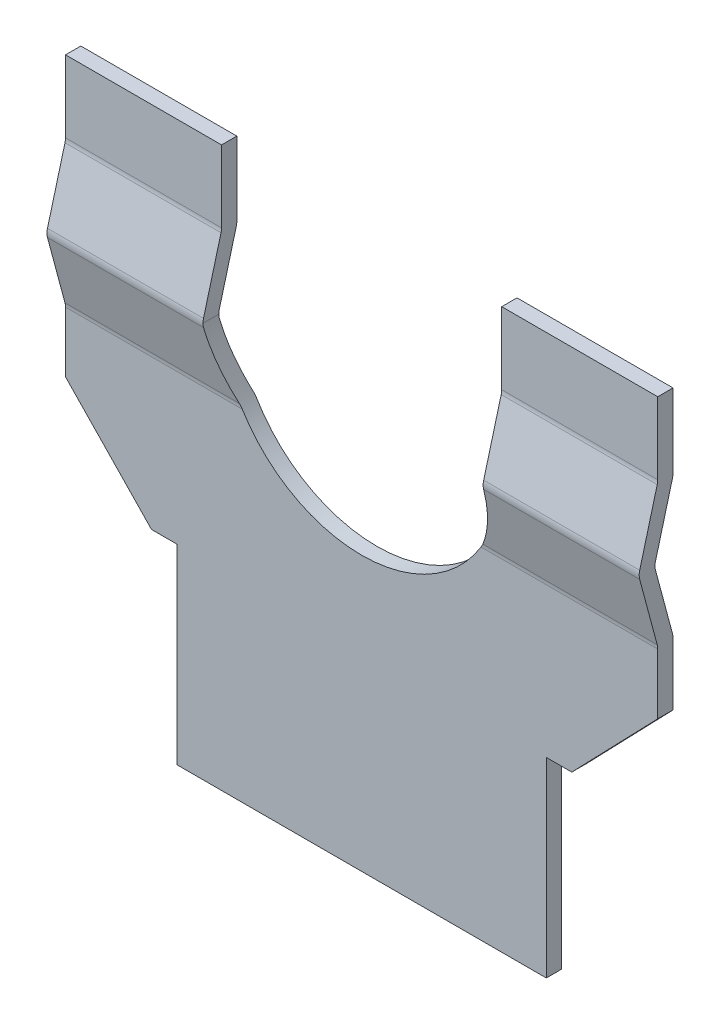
from build123d import *

# Parameters (mm, degrees)
EXTRUSION1_DEPTH             = 27
ENL_V_MAT_EXTRU_1_DEPTH      = 498.5
ENL_V_MAT_EXTRU_1_DEPTH_BACK = 498.5
CONG_1_R                     = 12


with BuildPart() as part:
    # Esquisse1 → Extrusion1 (new body)
    with BuildSketch(Plane.XY):
        with BuildLine():
            Line((-145, 0), (145, 0))
            Line((145, 0), (145, 150))
            Line((145, 150), (165, 150))
            Line((165, 150), (232.5, 220))
            Line((232.5, 220), (232.5, 439))
            Line((232.5, 439), (110, 439))
            Line((110, 439), (110, 325))
            ThreePointArc((110, 325), (0, 215), (-110, 325))
            Line((-110, 325), (-110, 439))
            Line((-110, 439), (-232.5, 439))
            Line((-232.5, 439), (-232.5, 220))
            Line((-232.5, 220), (-165, 150))
            Line((-165, 150), (-145, 150))
            Line((-145, 150), (-145, 0))
        make_face()
    extrude(amount=EXTRUSION1_DEPTH)

    # Esquisse2 → Enl_v. mat.-Extru.1 (cut, two sides: drawn at the far end of the back side and taken through both)
    with BuildSketch(Plane(origin=(0, 0, 0), x_dir=(0, 0, -1), z_dir=(1, 0, 0)).offset(-ENL_V_MAT_EXTRU_1_DEPTH_BACK)):
        Polygon((-12, -31.679798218), (-12, 269.019237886), (-27, 325), (-12, 380.980762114), (-12, 468.856351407), (-89.762797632, 468.856351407), (-89.762797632, -31.679798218), align=None)
        Polygon((-14.576685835, 325), (9.446286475, 414.65495321), (9.446286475, 235.34504679), align=None)
    extrude(amount=ENL_V_MAT_EXTRU_1_DEPTH + ENL_V_MAT_EXTRU_1_DEPTH_BACK, mode=Mode.SUBTRACT)

    # Cong_1
    cong_1_edges = [part.edges().sort_by_distance(p)[0] for p in [
        (171.25, 380.980762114, 12),
        (171.25, 325, 27),
        (163.594889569, 269.019237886, 12),
        (-163.594889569, 269.019237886, 12),
        (-171.25, 325, 27),
        (-171.25, 380.980762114, 12),
        (-164.053081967, 270.599067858, 0),
        (-171.25, 325, 14.576685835),
        (-171.25, 379.400932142, 0),
        (164.053081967, 270.599067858, 0),
        (171.25, 379.400932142, 0),
        (171.25, 325, 14.576685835),
    ]]
    fillet(cong_1_edges, radius=CONG_1_R)


solid = part.part
